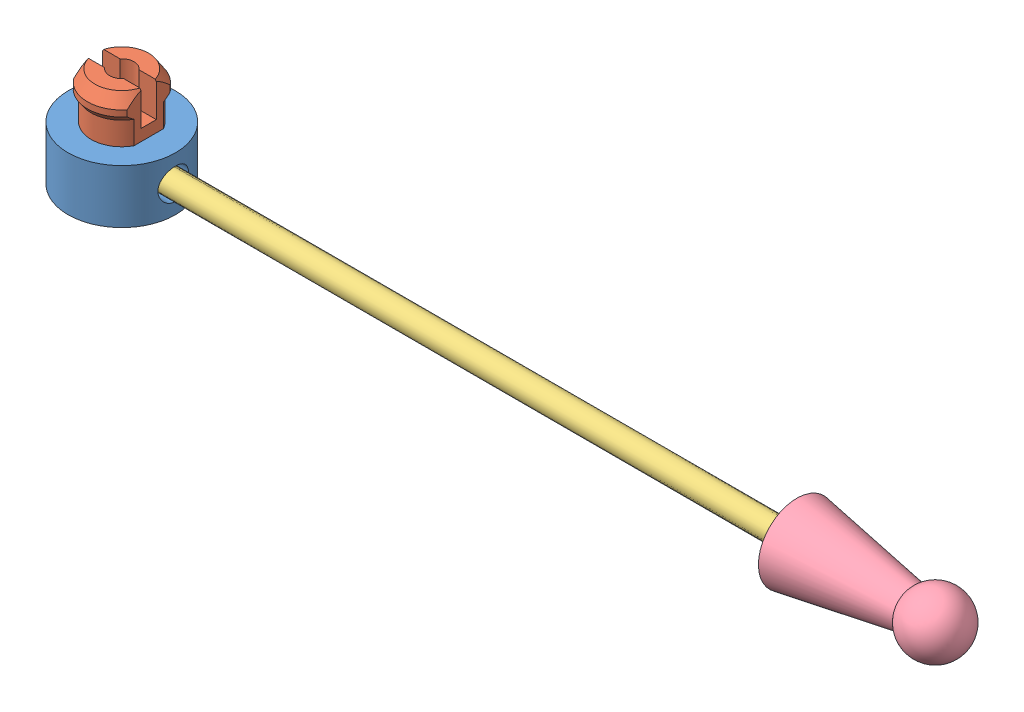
SolidWorks assembly tail base with peg.SLDASM, configuration Default (file format 4400). Lengths in mm.
Overall size (117 14.5 14).
4 component instances, 4 part files, 6 mates.
Components (placement in the parent):
- tail base-1: tail base.SLDPRT [Default] at (-15.694 0.5657 6.161) size (14 7 14)
- Male Connector-1: Male Connector.SLDPRT [Default] at (-15.694 7.5657 6.161) x (1 0 0) z (0 -1 0) size (7 8.96 6)
- pen-1: pen.SLDPRT [Default] at (80.306 4.0657 6.161) x (0 1 0) z (0 0 1) size (3 100 3)
- tail 1-1: tail 1.SLDPRT [Default] at (72.306 4.0657 6.161) x (0 0 -1) z (1 0 0) size (10 10 22)
Mates (geometry in assembly coordinates):
- Coincident1: coincident anti-aligned: plane of tail base-1 through (-15.694 7.5657 6.161) normal (0 1 0); plane of Male Connector-1 through (-15.694 7.5657 6.161) normal (0 -1 0)
- Concentric1: concentric aligned: circle of tail base-1; circle of Male Connector-1
- Coincident2: coincident anti-aligned: plane of tail base-1 through (-19.694 7.5657 -4.8699) normal (1 0 0); plane of pen-1 through (-19.694 4.0657 6.161) normal (-1 0 0)
- Concentric2: concentric aligned: cylinder of tail base-1 through (-19.694 4.0657 6.161) axis (1 0 0) radius 2; cylinder of pen-1 through (-19.694 4.0657 6.161) axis (1 0 0) radius 1.5
- Coincident3: coincident anti-aligned: plane of pen-1 through (80.306 4.0657 6.161) normal (1 0 0); plane of tail 1-1 through (80.306 4.0657 6.161) normal (-1 0 0)
- Concentric3: concentric anti-aligned: cylinder of pen-1 through (-19.694 4.0657 6.161) axis (1 0 0) radius 1.5; cylinder of tail 1-1 through (80.306 4.0657 6.161) axis (-1 0 0) radius 2.5
